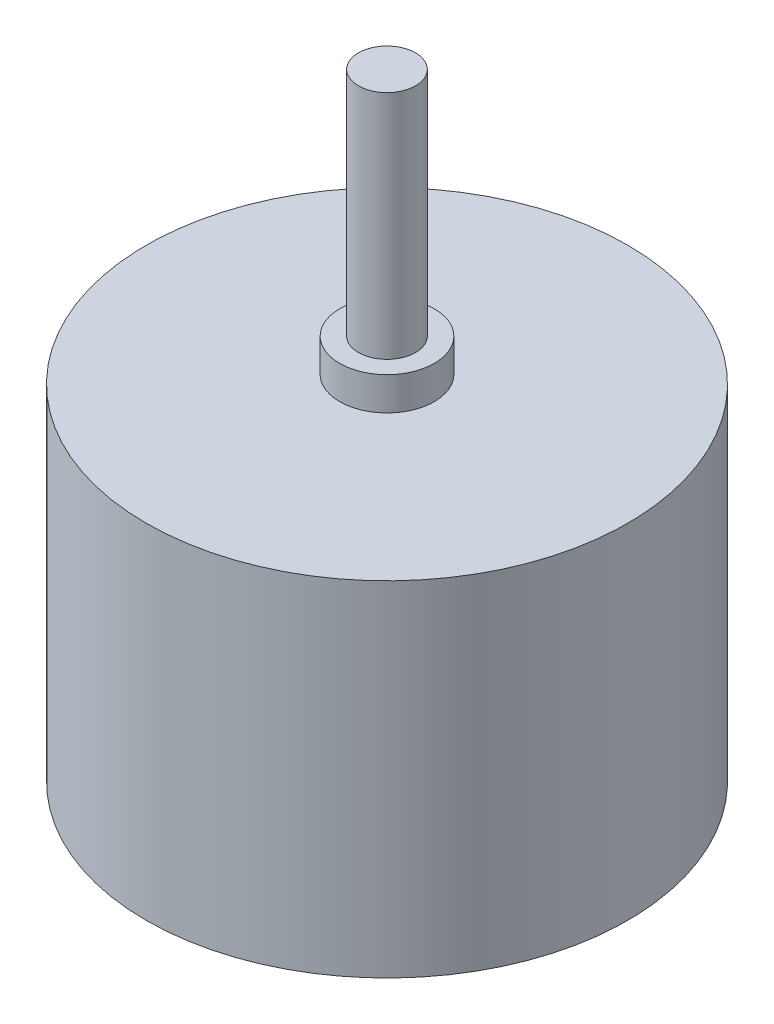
ISO-10303-21;
HEADER;
FILE_DESCRIPTION(('STEP AP214'),'2;1');
FILE_NAME('part.step','',(''),(''),'','','');
FILE_SCHEMA(('AUTOMOTIVE_DESIGN { 1 0 10303 214 1 1 1 1 }'));
ENDSEC;
DATA;
#1=APPLICATION_CONTEXT('core data for automotive mechanical design processes');
#2=APPLICATION_PROTOCOL_DEFINITION('international standard','automotive_design',2000,#1);
#3=PRODUCT_CONTEXT('',#1,'mechanical');
#4=PRODUCT('Part','Part','',(#3));
#5=PRODUCT_RELATED_PRODUCT_CATEGORY('part','',(#4));
#6=PRODUCT_DEFINITION_FORMATION('','',#4);
#7=PRODUCT_DEFINITION_CONTEXT('part definition',#1,'design');
#8=PRODUCT_DEFINITION('design','',#6,#7);
#9=PRODUCT_DEFINITION_SHAPE('','',#8);
#10=(LENGTH_UNIT() NAMED_UNIT(*) SI_UNIT(.MILLI.,.METRE.));
#11=(NAMED_UNIT(*) PLANE_ANGLE_UNIT() SI_UNIT($,.RADIAN.));
#12=(NAMED_UNIT(*) SI_UNIT($,.STERADIAN.) SOLID_ANGLE_UNIT());
#13=UNCERTAINTY_MEASURE_WITH_UNIT(LENGTH_MEASURE(1.E-05),#10,'distance_accuracy_value','');
#14=(GEOMETRIC_REPRESENTATION_CONTEXT(3) GLOBAL_UNCERTAINTY_ASSIGNED_CONTEXT((#13)) GLOBAL_UNIT_ASSIGNED_CONTEXT((#10,
#11,#12)) REPRESENTATION_CONTEXT('',''));
#15=CARTESIAN_POINT('',(0.,0.,0.));
#16=DIRECTION('',(0.,0.,1.));
#17=DIRECTION('',(1.,0.,0.));
#18=AXIS2_PLACEMENT_3D('',#15,#16,#17);
#19=CARTESIAN_POINT('',(5.55625,-44.4500000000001,0.));
#20=DIRECTION('',(0.,1.,0.));
#21=DIRECTION('',(0.,0.,1.));
#22=AXIS2_PLACEMENT_3D('',#19,#20,#21);
#23=PLANE('',#22);
#24=CARTESIAN_POINT('',(0.,-44.4500000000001,0.));
#25=DIRECTION('',(0.,1.,0.));
#26=DIRECTION('',(0.,0.,1.));
#27=AXIS2_PLACEMENT_3D('',#24,#25,#26);
#28=CIRCLE('',#27,5.55625);
#29=CARTESIAN_POINT('',(0.,-44.4500000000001,5.55625));
#30=VERTEX_POINT('',#29);
#31=EDGE_CURVE('E69',#30,#30,#28,.T.);
#32=ORIENTED_EDGE('',*,*,#31,.F.);
#33=EDGE_LOOP('',(#32));
#34=FACE_BOUND('',#33,.T.);
#35=ADVANCED_FACE('F32',(#34),#23,.F.);
#36=CARTESIAN_POINT('',(0.,88.4427999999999,0.));
#37=DIRECTION('',(0.,-1.,0.));
#38=DIRECTION('',(0.,0.,-1.));
#39=AXIS2_PLACEMENT_3D('',#36,#37,#38);
#40=PLANE('',#39);
#41=CARTESIAN_POINT('',(0.,88.4427999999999,0.));
#42=DIRECTION('',(0.,1.,0.));
#43=DIRECTION('',(0.,0.,1.));
#44=AXIS2_PLACEMENT_3D('',#41,#42,#43);
#45=CIRCLE('',#44,5.27050000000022);
#46=CARTESIAN_POINT('',(0.,88.4427999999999,5.27050000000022));
#47=VERTEX_POINT('',#46);
#48=EDGE_CURVE('E10',#47,#47,#45,.T.);
#49=ORIENTED_EDGE('',*,*,#48,.T.);
#50=EDGE_LOOP('',(#49));
#51=FACE_BOUND('',#50,.T.);
#52=ADVANCED_FACE('F76',(#51),#40,.F.);
#53=CARTESIAN_POINT('',(0.,1.20376872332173,0.));
#54=DIRECTION('',(0.,1.,0.));
#55=DIRECTION('',(0.,0.,1.));
#56=AXIS2_PLACEMENT_3D('',#53,#54,#55);
#57=CYLINDRICAL_SURFACE('',#56,5.27050000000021);
#58=ORIENTED_EDGE('',*,*,#48,.F.);
#59=EDGE_LOOP('',(#58));
#60=FACE_BOUND('',#59,.T.);
#61=CARTESIAN_POINT('',(0.,45.7962,0.));
#62=DIRECTION('',(0.,1.,0.));
#63=DIRECTION('',(0.,0.,1.));
#64=AXIS2_PLACEMENT_3D('',#61,#62,#63);
#65=CIRCLE('',#64,5.2705000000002);
#66=CARTESIAN_POINT('',(0.,45.7962,5.2705000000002));
#67=VERTEX_POINT('',#66);
#68=EDGE_CURVE('E38',#67,#67,#65,.T.);
#69=ORIENTED_EDGE('',*,*,#68,.T.);
#70=EDGE_LOOP('',(#69));
#71=FACE_BOUND('',#70,.T.);
#72=ADVANCED_FACE('F80',(#60,#71),#57,.T.);
#73=CARTESIAN_POINT('',(5.2705000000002,45.7962,0.));
#74=DIRECTION('',(0.,-1.,0.));
#75=DIRECTION('',(0.,0.,-1.));
#76=AXIS2_PLACEMENT_3D('',#73,#74,#75);
#77=PLANE('',#76);
#78=ORIENTED_EDGE('',*,*,#68,.F.);
#79=EDGE_LOOP('',(#78));
#80=FACE_BOUND('',#79,.T.);
#81=CARTESIAN_POINT('',(0.,45.7962,0.));
#82=DIRECTION('',(0.,1.,0.));
#83=DIRECTION('',(0.,0.,1.));
#84=AXIS2_PLACEMENT_3D('',#81,#82,#83);
#85=CIRCLE('',#84,8.73124999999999);
#86=CARTESIAN_POINT('',(0.,45.7962,8.73124999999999));
#87=VERTEX_POINT('',#86);
#88=EDGE_CURVE('E42',#87,#87,#85,.T.);
#89=ORIENTED_EDGE('',*,*,#88,.T.);
#90=EDGE_LOOP('',(#89));
#91=FACE_BOUND('',#90,.T.);
#92=ADVANCED_FACE('F84',(#80,#91),#77,.F.);
#93=CARTESIAN_POINT('',(0.,1.20376872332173,0.));
#94=DIRECTION('',(0.,1.,0.));
#95=DIRECTION('',(0.,0.,1.));
#96=AXIS2_PLACEMENT_3D('',#93,#94,#95);
#97=CYLINDRICAL_SURFACE('',#96,8.73124999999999);
#98=ORIENTED_EDGE('',*,*,#88,.F.);
#99=EDGE_LOOP('',(#98));
#100=FACE_BOUND('',#99,.T.);
#101=CARTESIAN_POINT('',(0.,39.6747999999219,0.));
#102=DIRECTION('',(0.,1.,0.));
#103=DIRECTION('',(0.,0.,1.));
#104=AXIS2_PLACEMENT_3D('',#101,#102,#103);
#105=CIRCLE('',#104,8.73124999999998);
#106=CARTESIAN_POINT('',(0.,39.6747999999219,8.73124999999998));
#107=VERTEX_POINT('',#106);
#108=EDGE_CURVE('E46',#107,#107,#105,.T.);
#109=ORIENTED_EDGE('',*,*,#108,.T.);
#110=EDGE_LOOP('',(#109));
#111=FACE_BOUND('',#110,.T.);
#112=ADVANCED_FACE('F90',(#100,#111),#97,.T.);
#113=CARTESIAN_POINT('',(8.73124999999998,39.6747999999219,0.));
#114=DIRECTION('',(0.,1.,0.));
#115=DIRECTION('',(0.,0.,1.));
#116=AXIS2_PLACEMENT_3D('',#113,#114,#115);
#117=PLANE('',#116);
#118=ORIENTED_EDGE('',*,*,#108,.F.);
#119=EDGE_LOOP('',(#118));
#120=FACE_BOUND('',#119,.T.);
#121=CARTESIAN_POINT('',(0.,39.6747999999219,0.));
#122=DIRECTION('',(0.,1.,0.));
#123=DIRECTION('',(0.,0.,1.));
#124=AXIS2_PLACEMENT_3D('',#121,#122,#123);
#125=CIRCLE('',#124,4.96569999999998);
#126=CARTESIAN_POINT('',(0.,39.6747999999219,4.96569999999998));
#127=VERTEX_POINT('',#126);
#128=EDGE_CURVE('E51',#127,#127,#125,.T.);
#129=ORIENTED_EDGE('',*,*,#128,.T.);
#130=EDGE_LOOP('',(#129));
#131=FACE_BOUND('',#130,.T.);
#132=ADVANCED_FACE('F94',(#120,#131),#117,.F.);
#133=CARTESIAN_POINT('',(0.,1.20376872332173,0.));
#134=DIRECTION('',(0.,1.,0.));
#135=DIRECTION('',(0.,0.,1.));
#136=AXIS2_PLACEMENT_3D('',#133,#134,#135);
#137=CYLINDRICAL_SURFACE('',#136,4.96569999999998);
#138=ORIENTED_EDGE('',*,*,#128,.F.);
#139=EDGE_LOOP('',(#138));
#140=FACE_BOUND('',#139,.T.);
#141=CARTESIAN_POINT('',(0.,38.1,0.));
#142=DIRECTION('',(0.,1.,0.));
#143=DIRECTION('',(0.,0.,1.));
#144=AXIS2_PLACEMENT_3D('',#141,#142,#143);
#145=CIRCLE('',#144,4.96569999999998);
#146=CARTESIAN_POINT('',(0.,38.1,4.96569999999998));
#147=VERTEX_POINT('',#146);
#148=EDGE_CURVE('E54',#147,#147,#145,.T.);
#149=ORIENTED_EDGE('',*,*,#148,.T.);
#150=EDGE_LOOP('',(#149));
#151=FACE_BOUND('',#150,.T.);
#152=ADVANCED_FACE('F98',(#140,#151),#137,.T.);
#153=CARTESIAN_POINT('',(4.96569999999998,38.1,0.));
#154=DIRECTION('',(0.,-1.,0.));
#155=DIRECTION('',(0.,0.,-1.));
#156=AXIS2_PLACEMENT_3D('',#153,#154,#155);
#157=PLANE('',#156);
#158=ORIENTED_EDGE('',*,*,#148,.F.);
#159=EDGE_LOOP('',(#158));
#160=FACE_BOUND('',#159,.T.);
#161=CARTESIAN_POINT('',(0.,38.1,0.));
#162=DIRECTION('',(0.,1.,0.));
#163=DIRECTION('',(0.,0.,1.));
#164=AXIS2_PLACEMENT_3D('',#161,#162,#163);
#165=CIRCLE('',#164,44.45);
#166=CARTESIAN_POINT('',(0.,38.1,44.45));
#167=VERTEX_POINT('',#166);
#168=EDGE_CURVE('E57',#167,#167,#165,.T.);
#169=ORIENTED_EDGE('',*,*,#168,.T.);
#170=EDGE_LOOP('',(#169));
#171=FACE_BOUND('',#170,.T.);
#172=ADVANCED_FACE('F102',(#160,#171),#157,.F.);
#173=CARTESIAN_POINT('',(0.,1.20376872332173,0.));
#174=DIRECTION('',(0.,1.,0.));
#175=DIRECTION('',(0.,0.,1.));
#176=AXIS2_PLACEMENT_3D('',#173,#174,#175);
#177=CYLINDRICAL_SURFACE('',#176,44.45);
#178=ORIENTED_EDGE('',*,*,#168,.F.);
#179=EDGE_LOOP('',(#178));
#180=FACE_BOUND('',#179,.T.);
#181=CARTESIAN_POINT('',(0.,-25.4000000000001,0.));
#182=DIRECTION('',(0.,1.,0.));
#183=DIRECTION('',(0.,0.,1.));
#184=AXIS2_PLACEMENT_3D('',#181,#182,#183);
#185=CIRCLE('',#184,44.45);
#186=CARTESIAN_POINT('',(0.,-25.4000000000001,44.45));
#187=VERTEX_POINT('',#186);
#188=EDGE_CURVE('E60',#187,#187,#185,.T.);
#189=ORIENTED_EDGE('',*,*,#188,.T.);
#190=EDGE_LOOP('',(#189));
#191=FACE_BOUND('',#190,.T.);
#192=ADVANCED_FACE('F106',(#180,#191),#177,.T.);
#193=CARTESIAN_POINT('',(44.45,-25.4000000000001,0.));
#194=DIRECTION('',(0.,1.,0.));
#195=DIRECTION('',(0.,0.,1.));
#196=AXIS2_PLACEMENT_3D('',#193,#194,#195);
#197=PLANE('',#196);
#198=ORIENTED_EDGE('',*,*,#188,.F.);
#199=EDGE_LOOP('',(#198));
#200=FACE_BOUND('',#199,.T.);
#201=CARTESIAN_POINT('',(0.,-25.4000000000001,0.));
#202=DIRECTION('',(0.,1.,0.));
#203=DIRECTION('',(0.,0.,1.));
#204=AXIS2_PLACEMENT_3D('',#201,#202,#203);
#205=CIRCLE('',#204,6.11094063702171);
#206=CARTESIAN_POINT('',(0.,-25.4000000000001,6.11094063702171));
#207=VERTEX_POINT('',#206);
#208=EDGE_CURVE('E63',#207,#207,#205,.T.);
#209=ORIENTED_EDGE('',*,*,#208,.T.);
#210=EDGE_LOOP('',(#209));
#211=FACE_BOUND('',#210,.T.);
#212=ADVANCED_FACE('F110',(#200,#211),#197,.F.);
#213=CARTESIAN_POINT('',(0.,-26.9240000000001,0.));
#214=DIRECTION('',(0.,1.,0.));
#215=DIRECTION('',(0.,0.,1.));
#216=AXIS2_PLACEMENT_3D('',#213,#214,#215);
#217=CONICAL_SURFACE('',#216,5.55625,0.349065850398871);
#218=ORIENTED_EDGE('',*,*,#208,.F.);
#219=EDGE_LOOP('',(#218));
#220=FACE_BOUND('',#219,.T.);
#221=CARTESIAN_POINT('',(0.,-26.9240000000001,0.));
#222=DIRECTION('',(0.,1.,0.));
#223=DIRECTION('',(0.,0.,1.));
#224=AXIS2_PLACEMENT_3D('',#221,#222,#223);
#225=CIRCLE('',#224,5.55625);
#226=CARTESIAN_POINT('',(0.,-26.9240000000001,5.55625));
#227=VERTEX_POINT('',#226);
#228=EDGE_CURVE('E66',#227,#227,#225,.T.);
#229=ORIENTED_EDGE('',*,*,#228,.T.);
#230=EDGE_LOOP('',(#229));
#231=FACE_BOUND('',#230,.T.);
#232=ADVANCED_FACE('F114',(#220,#231),#217,.T.);
#233=CARTESIAN_POINT('',(0.,1.20376872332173,0.));
#234=DIRECTION('',(0.,1.,0.));
#235=DIRECTION('',(0.,0.,1.));
#236=AXIS2_PLACEMENT_3D('',#233,#234,#235);
#237=CYLINDRICAL_SURFACE('',#236,5.55625);
#238=ORIENTED_EDGE('',*,*,#228,.F.);
#239=EDGE_LOOP('',(#238));
#240=FACE_BOUND('',#239,.T.);
#241=ORIENTED_EDGE('',*,*,#31,.T.);
#242=EDGE_LOOP('',(#241));
#243=FACE_BOUND('',#242,.T.);
#244=ADVANCED_FACE('F73',(#240,#243),#237,.T.);
#245=CLOSED_SHELL('',(#35,#52,#72,#92,#112,#132,#152,#172,#192,#212,#232,#244));
#246=MANIFOLD_SOLID_BREP('B2',#245);
#247=ADVANCED_BREP_SHAPE_REPRESENTATION('',(#18,#246),#14);
#248=SHAPE_DEFINITION_REPRESENTATION(#9,#247);
ENDSEC;
END-ISO-10303-21;
